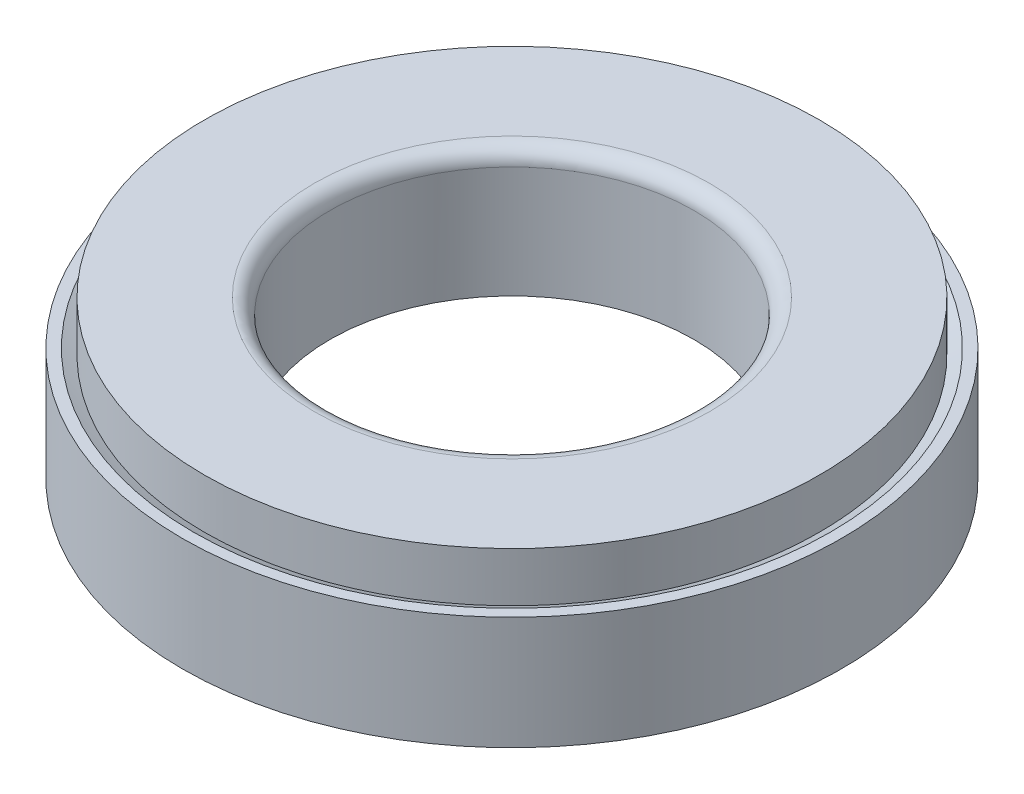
ISO-10303-21;
HEADER;
FILE_DESCRIPTION(('STEP AP214'),'2;1');
FILE_NAME('part.step','',(''),(''),'','','');
FILE_SCHEMA(('AUTOMOTIVE_DESIGN { 1 0 10303 214 1 1 1 1 }'));
ENDSEC;
DATA;
#1=APPLICATION_CONTEXT('core data for automotive mechanical design processes');
#2=APPLICATION_PROTOCOL_DEFINITION('international standard','automotive_design',2000,#1);
#3=PRODUCT_CONTEXT('',#1,'mechanical');
#4=PRODUCT('Part','Part','',(#3));
#5=PRODUCT_RELATED_PRODUCT_CATEGORY('part','',(#4));
#6=PRODUCT_DEFINITION_FORMATION('','',#4);
#7=PRODUCT_DEFINITION_CONTEXT('part definition',#1,'design');
#8=PRODUCT_DEFINITION('design','',#6,#7);
#9=PRODUCT_DEFINITION_SHAPE('','',#8);
#10=(LENGTH_UNIT() NAMED_UNIT(*) SI_UNIT(.MILLI.,.METRE.));
#11=(NAMED_UNIT(*) PLANE_ANGLE_UNIT() SI_UNIT($,.RADIAN.));
#12=(NAMED_UNIT(*) SI_UNIT($,.STERADIAN.) SOLID_ANGLE_UNIT());
#13=UNCERTAINTY_MEASURE_WITH_UNIT(LENGTH_MEASURE(1.E-05),#10,'distance_accuracy_value','');
#14=(GEOMETRIC_REPRESENTATION_CONTEXT(3) GLOBAL_UNCERTAINTY_ASSIGNED_CONTEXT((#13)) GLOBAL_UNIT_ASSIGNED_CONTEXT((#10,
#11,#12)) REPRESENTATION_CONTEXT('',''));
#15=CARTESIAN_POINT('',(0.,0.,0.));
#16=DIRECTION('',(0.,0.,1.));
#17=DIRECTION('',(1.,0.,0.));
#18=AXIS2_PLACEMENT_3D('',#15,#16,#17);
#19=CARTESIAN_POINT('',(0.,25.,0.));
#20=DIRECTION('',(0.,-1.,0.));
#21=DIRECTION('',(0.,0.,-1.));
#22=AXIS2_PLACEMENT_3D('',#19,#20,#21);
#23=CYLINDRICAL_SURFACE('',#22,49.);
#24=CARTESIAN_POINT('',(0.,17.0854664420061,0.));
#25=DIRECTION('',(0.,1.,0.));
#26=DIRECTION('',(0.,0.,1.));
#27=AXIS2_PLACEMENT_3D('',#24,#25,#26);
#28=CIRCLE('',#27,49.);
#29=CARTESIAN_POINT('',(0.,17.0854664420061,49.));
#30=VERTEX_POINT('',#29);
#31=EDGE_CURVE('P0_E29',#30,#30,#28,.T.);
#32=ORIENTED_EDGE('',*,*,#31,.T.);
#33=EDGE_LOOP('',(#32));
#34=FACE_BOUND('',#33,.T.);
#35=CARTESIAN_POINT('',(0.,25.,0.));
#36=DIRECTION('',(0.,1.,0.));
#37=DIRECTION('',(0.,0.,1.));
#38=AXIS2_PLACEMENT_3D('',#35,#36,#37);
#39=CIRCLE('',#38,49.);
#40=CARTESIAN_POINT('',(0.,25.,49.));
#41=VERTEX_POINT('',#40);
#42=EDGE_CURVE('P0_E25',#41,#41,#39,.T.);
#43=ORIENTED_EDGE('',*,*,#42,.F.);
#44=EDGE_LOOP('',(#43));
#45=FACE_BOUND('',#44,.T.);
#46=ADVANCED_FACE('P0_F14',(#34,#45),#23,.T.);
#47=CARTESIAN_POINT('',(0.,25.,0.));
#48=DIRECTION('',(0.,1.,0.));
#49=DIRECTION('',(0.,0.,1.));
#50=AXIS2_PLACEMENT_3D('',#47,#48,#49);
#51=PLANE('',#50);
#52=CARTESIAN_POINT('',(0.,25.,0.));
#53=DIRECTION('',(0.,1.,0.));
#54=DIRECTION('',(0.,0.,1.));
#55=AXIS2_PLACEMENT_3D('',#52,#53,#54);
#56=CIRCLE('',#55,31.5);
#57=CARTESIAN_POINT('',(0.,25.,31.5));
#58=VERTEX_POINT('',#57);
#59=EDGE_CURVE('P0_E21',#58,#58,#56,.F.);
#60=ORIENTED_EDGE('',*,*,#59,.T.);
#61=EDGE_LOOP('',(#60));
#62=FACE_BOUND('',#61,.T.);
#63=ORIENTED_EDGE('',*,*,#42,.T.);
#64=EDGE_LOOP('',(#63));
#65=FACE_BOUND('',#64,.T.);
#66=ADVANCED_FACE('P0_F92',(#62,#65),#51,.T.);
#67=CARTESIAN_POINT('',(0.,112.980729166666,0.));
#68=DIRECTION('',(-1.,0.,0.));
#69=DIRECTION('',(0.,-1.,0.));
#70=AXIS2_PLACEMENT_3D('',#67,#68,#69);
#71=SPHERICAL_SURFACE('',#70,107.68891035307);
#72=CARTESIAN_POINT('',(0.,112.980729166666,0.));
#73=DIRECTION('',(0.,1.,0.));
#74=DIRECTION('',(0.,0.,1.));
#75=AXIS2_PLACEMENT_3D('',#72,#73,#74);
#76=SPHERICAL_SURFACE('',#75,107.68891035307);
#77=CARTESIAN_POINT('',(0.,10.8,0.));
#78=DIRECTION('',(0.,1.,0.));
#79=DIRECTION('',(0.,0.,1.));
#80=AXIS2_PLACEMENT_3D('',#77,#78,#79);
#81=CIRCLE('',#80,34.);
#82=CARTESIAN_POINT('',(0.,10.8,34.));
#83=VERTEX_POINT('',#82);
#84=EDGE_CURVE('P0_E49',#83,#83,#81,.T.);
#85=ORIENTED_EDGE('',*,*,#84,.T.);
#86=EDGE_LOOP('',(#85));
#87=FACE_BOUND('',#86,.T.);
#88=ORIENTED_EDGE('',*,*,#31,.F.);
#89=EDGE_LOOP('',(#88));
#90=FACE_BOUND('',#89,.T.);
#91=ADVANCED_FACE('P0_F53',(#87,#90),#76,.T.);
#92=CARTESIAN_POINT('',(0.,4.7,0.));
#93=DIRECTION('',(0.,1.,0.));
#94=DIRECTION('',(0.,0.,1.));
#95=AXIS2_PLACEMENT_3D('',#92,#93,#94);
#96=CYLINDRICAL_SURFACE('',#95,34.);
#97=CARTESIAN_POINT('',(0.,7.75,0.));
#98=DIRECTION('',(0.,1.,0.));
#99=DIRECTION('',(0.,0.,1.));
#100=AXIS2_PLACEMENT_3D('',#97,#98,#99);
#101=CIRCLE('',#100,34.);
#102=CARTESIAN_POINT('',(0.,7.75,34.));
#103=VERTEX_POINT('',#102);
#104=EDGE_CURVE('P0_E40',#103,#103,#101,.T.);
#105=ORIENTED_EDGE('',*,*,#104,.F.);
#106=EDGE_LOOP('',(#105));
#107=FACE_BOUND('',#106,.T.);
#108=CARTESIAN_POINT('',(0.,4.7,0.));
#109=DIRECTION('',(0.,1.,0.));
#110=DIRECTION('',(0.,0.,1.));
#111=AXIS2_PLACEMENT_3D('',#108,#109,#110);
#112=CIRCLE('',#111,34.);
#113=CARTESIAN_POINT('',(0.,4.7,34.));
#114=VERTEX_POINT('',#113);
#115=EDGE_CURVE('P0_E33',#114,#114,#112,.T.);
#116=ORIENTED_EDGE('',*,*,#115,.T.);
#117=EDGE_LOOP('',(#116));
#118=FACE_BOUND('',#117,.T.);
#119=ADVANCED_FACE('P0_F75',(#107,#118),#96,.T.);
#120=CARTESIAN_POINT('',(0.,4.7,0.));
#121=DIRECTION('',(0.,1.,0.));
#122=DIRECTION('',(0.,0.,1.));
#123=AXIS2_PLACEMENT_3D('',#120,#121,#122);
#124=PLANE('',#123);
#125=CARTESIAN_POINT('',(0.,4.7,0.));
#126=DIRECTION('',(0.,-1.,0.));
#127=DIRECTION('',(0.,0.,-1.));
#128=AXIS2_PLACEMENT_3D('',#125,#126,#127);
#129=CIRCLE('',#128,29.);
#130=CARTESIAN_POINT('',(0.,4.7,-29.));
#131=VERTEX_POINT('',#130);
#132=EDGE_CURVE('P0_E37',#131,#131,#129,.T.);
#133=ORIENTED_EDGE('',*,*,#132,.F.);
#134=EDGE_LOOP('',(#133));
#135=FACE_BOUND('',#134,.T.);
#136=ORIENTED_EDGE('',*,*,#115,.F.);
#137=EDGE_LOOP('',(#136));
#138=FACE_BOUND('',#137,.T.);
#139=ADVANCED_FACE('P0_F78',(#135,#138),#124,.F.);
#140=CARTESIAN_POINT('',(0.,25.,0.));
#141=DIRECTION('',(0.,-1.,0.));
#142=DIRECTION('',(0.,0.,-1.));
#143=AXIS2_PLACEMENT_3D('',#140,#141,#142);
#144=CYLINDRICAL_SURFACE('',#143,29.);
#145=CARTESIAN_POINT('',(0.,22.5,0.));
#146=DIRECTION('',(0.,1.,0.));
#147=DIRECTION('',(0.,0.,1.));
#148=AXIS2_PLACEMENT_3D('',#145,#146,#147);
#149=CIRCLE('',#148,29.);
#150=CARTESIAN_POINT('',(0.,22.5,29.));
#151=VERTEX_POINT('',#150);
#152=EDGE_CURVE('P0_E10',#151,#151,#149,.T.);
#153=ORIENTED_EDGE('',*,*,#152,.T.);
#154=EDGE_LOOP('',(#153));
#155=FACE_BOUND('',#154,.T.);
#156=ORIENTED_EDGE('',*,*,#132,.T.);
#157=EDGE_LOOP('',(#156));
#158=FACE_BOUND('',#157,.T.);
#159=ADVANCED_FACE('P0_F71',(#155,#158),#144,.F.);
#160=CARTESIAN_POINT('',(-34.,7.75,0.));
#161=DIRECTION('',(0.,-1.,0.));
#162=DIRECTION('',(0.,0.,-1.));
#163=AXIS2_PLACEMENT_3D('',#160,#161,#162);
#164=PLANE('',#163);
#165=CARTESIAN_POINT('',(0.,7.75,0.));
#166=DIRECTION('',(0.,1.,0.));
#167=DIRECTION('',(0.,0.,1.));
#168=AXIS2_PLACEMENT_3D('',#165,#166,#167);
#169=CIRCLE('',#168,31.5);
#170=CARTESIAN_POINT('',(0.,7.75,31.5));
#171=VERTEX_POINT('',#170);
#172=EDGE_CURVE('P0_E43',#171,#171,#169,.T.);
#173=ORIENTED_EDGE('',*,*,#172,.F.);
#174=EDGE_LOOP('',(#173));
#175=FACE_BOUND('',#174,.T.);
#176=ORIENTED_EDGE('',*,*,#104,.T.);
#177=EDGE_LOOP('',(#176));
#178=FACE_BOUND('',#177,.T.);
#179=ADVANCED_FACE('P0_F65',(#175,#178),#164,.F.);
#180=CARTESIAN_POINT('',(0.,25.,0.));
#181=DIRECTION('',(0.,1.,0.));
#182=DIRECTION('',(0.,0.,1.));
#183=AXIS2_PLACEMENT_3D('',#180,#181,#182);
#184=CYLINDRICAL_SURFACE('',#183,31.5);
#185=CARTESIAN_POINT('',(0.,10.8,0.));
#186=DIRECTION('',(0.,1.,0.));
#187=DIRECTION('',(0.,0.,1.));
#188=AXIS2_PLACEMENT_3D('',#185,#186,#187);
#189=CIRCLE('',#188,31.5);
#190=CARTESIAN_POINT('',(0.,10.8,31.5));
#191=VERTEX_POINT('',#190);
#192=EDGE_CURVE('P0_E46',#191,#191,#189,.T.);
#193=ORIENTED_EDGE('',*,*,#192,.F.);
#194=EDGE_LOOP('',(#193));
#195=FACE_BOUND('',#194,.T.);
#196=ORIENTED_EDGE('',*,*,#172,.T.);
#197=EDGE_LOOP('',(#196));
#198=FACE_BOUND('',#197,.T.);
#199=ADVANCED_FACE('P0_F59',(#195,#198),#184,.T.);
#200=CARTESIAN_POINT('',(-34.,10.8,0.));
#201=DIRECTION('',(0.,1.,0.));
#202=DIRECTION('',(0.,0.,1.));
#203=AXIS2_PLACEMENT_3D('',#200,#201,#202);
#204=PLANE('',#203);
#205=ORIENTED_EDGE('',*,*,#84,.F.);
#206=EDGE_LOOP('',(#205));
#207=FACE_BOUND('',#206,.T.);
#208=ORIENTED_EDGE('',*,*,#192,.T.);
#209=EDGE_LOOP('',(#208));
#210=FACE_BOUND('',#209,.T.);
#211=ADVANCED_FACE('P0_F56',(#207,#210),#204,.F.);
#212=CARTESIAN_POINT('',(0.,22.5,0.));
#213=DIRECTION('',(0.,1.,0.));
#214=DIRECTION('',(0.,0.,1.));
#215=AXIS2_PLACEMENT_3D('',#212,#213,#214);
#216=TOROIDAL_SURFACE('',#215,31.5,2.5);
#217=ORIENTED_EDGE('',*,*,#152,.F.);
#218=EDGE_LOOP('',(#217));
#219=FACE_BOUND('',#218,.T.);
#220=ORIENTED_EDGE('',*,*,#59,.F.);
#221=EDGE_LOOP('',(#220));
#222=FACE_BOUND('',#221,.T.);
#223=ADVANCED_FACE('P0_F16',(#219,#222),#216,.T.);
#224=CLOSED_SHELL('',(#46,#66,#91,#119,#139,#159,#179,#199,#211,#223));
#225=MANIFOLD_SOLID_BREP('P0_B1',#224);
#226=CARTESIAN_POINT('',(0.,18.,0.));
#227=DIRECTION('',(0.,-1.,0.));
#228=DIRECTION('',(0.,0.,-1.));
#229=AXIS2_PLACEMENT_3D('',#226,#227,#228);
#230=CYLINDRICAL_SURFACE('',#229,52.5);
#231=CARTESIAN_POINT('',(0.,18.,0.));
#232=DIRECTION('',(0.,1.,0.));
#233=DIRECTION('',(0.,0.,1.));
#234=AXIS2_PLACEMENT_3D('',#231,#232,#233);
#235=CIRCLE('',#234,52.5);
#236=CARTESIAN_POINT('',(0.,18.,52.5));
#237=VERTEX_POINT('',#236);
#238=EDGE_CURVE('P1_E9',#237,#237,#235,.T.);
#239=ORIENTED_EDGE('',*,*,#238,.F.);
#240=EDGE_LOOP('',(#239));
#241=FACE_BOUND('',#240,.T.);
#242=CARTESIAN_POINT('',(0.,0.,0.));
#243=DIRECTION('',(0.,1.,0.));
#244=DIRECTION('',(0.,0.,1.));
#245=AXIS2_PLACEMENT_3D('',#242,#243,#244);
#246=CIRCLE('',#245,52.5);
#247=CARTESIAN_POINT('',(0.,0.,52.5));
#248=VERTEX_POINT('',#247);
#249=EDGE_CURVE('P1_E20',#248,#248,#246,.T.);
#250=ORIENTED_EDGE('',*,*,#249,.T.);
#251=EDGE_LOOP('',(#250));
#252=FACE_BOUND('',#251,.T.);
#253=ADVANCED_FACE('P1_F13',(#241,#252),#230,.T.);
#254=CARTESIAN_POINT('',(0.,18.,0.));
#255=DIRECTION('',(0.,1.,0.));
#256=DIRECTION('',(0.,0.,1.));
#257=AXIS2_PLACEMENT_3D('',#254,#255,#256);
#258=PLANE('',#257);
#259=CARTESIAN_POINT('',(0.,18.,0.));
#260=DIRECTION('',(0.,1.,0.));
#261=DIRECTION('',(0.,0.,1.));
#262=AXIS2_PLACEMENT_3D('',#259,#260,#261);
#263=CIRCLE('',#262,50.7500000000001);
#264=CARTESIAN_POINT('',(0.,18.,50.7500000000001));
#265=VERTEX_POINT('',#264);
#266=EDGE_CURVE('P1_E35',#265,#265,#263,.T.);
#267=ORIENTED_EDGE('',*,*,#266,.F.);
#268=EDGE_LOOP('',(#267));
#269=FACE_BOUND('',#268,.T.);
#270=ORIENTED_EDGE('',*,*,#238,.T.);
#271=EDGE_LOOP('',(#270));
#272=FACE_BOUND('',#271,.T.);
#273=ADVANCED_FACE('P1_F55',(#269,#272),#258,.T.);
#274=CARTESIAN_POINT('',(0.,0.,0.));
#275=DIRECTION('',(0.,1.,0.));
#276=DIRECTION('',(0.,0.,1.));
#277=AXIS2_PLACEMENT_3D('',#274,#275,#276);
#278=PLANE('',#277);
#279=CARTESIAN_POINT('',(0.,0.,0.));
#280=DIRECTION('',(0.,-1.,0.));
#281=DIRECTION('',(0.,0.,-1.));
#282=AXIS2_PLACEMENT_3D('',#279,#280,#281);
#283=CIRCLE('',#282,39.);
#284=CARTESIAN_POINT('',(0.,0.,-39.));
#285=VERTEX_POINT('',#284);
#286=EDGE_CURVE('P1_E27',#285,#285,#283,.T.);
#287=ORIENTED_EDGE('',*,*,#286,.F.);
#288=EDGE_LOOP('',(#287));
#289=FACE_BOUND('',#288,.T.);
#290=ORIENTED_EDGE('',*,*,#249,.F.);
#291=EDGE_LOOP('',(#290));
#292=FACE_BOUND('',#291,.T.);
#293=ADVANCED_FACE('P1_F60',(#289,#292),#278,.F.);
#294=CARTESIAN_POINT('',(0.,9.,0.));
#295=DIRECTION('',(0.,-1.,0.));
#296=DIRECTION('',(0.,0.,-1.));
#297=AXIS2_PLACEMENT_3D('',#294,#295,#296);
#298=CYLINDRICAL_SURFACE('',#297,39.);
#299=CARTESIAN_POINT('',(0.,9.,0.));
#300=DIRECTION('',(0.,-1.,0.));
#301=DIRECTION('',(0.,0.,-1.));
#302=AXIS2_PLACEMENT_3D('',#299,#300,#301);
#303=CIRCLE('',#302,39.);
#304=CARTESIAN_POINT('',(0.,9.,-39.));
#305=VERTEX_POINT('',#304);
#306=EDGE_CURVE('P1_E25',#305,#305,#303,.T.);
#307=ORIENTED_EDGE('',*,*,#306,.F.);
#308=EDGE_LOOP('',(#307));
#309=FACE_BOUND('',#308,.T.);
#310=ORIENTED_EDGE('',*,*,#286,.T.);
#311=EDGE_LOOP('',(#310));
#312=FACE_BOUND('',#311,.T.);
#313=ADVANCED_FACE('P1_F67',(#309,#312),#298,.F.);
#314=CARTESIAN_POINT('',(0.,9.,0.));
#315=DIRECTION('',(0.,-1.,0.));
#316=DIRECTION('',(0.,0.,-1.));
#317=AXIS2_PLACEMENT_3D('',#314,#315,#316);
#318=PLANE('',#317);
#319=CARTESIAN_POINT('',(0.,9.,0.));
#320=DIRECTION('',(0.,-1.,0.));
#321=DIRECTION('',(0.,0.,-1.));
#322=AXIS2_PLACEMENT_3D('',#319,#320,#321);
#323=CIRCLE('',#322,34.);
#324=CARTESIAN_POINT('',(0.,9.,-34.));
#325=VERTEX_POINT('',#324);
#326=EDGE_CURVE('P1_E30',#325,#325,#323,.T.);
#327=ORIENTED_EDGE('',*,*,#326,.F.);
#328=EDGE_LOOP('',(#327));
#329=FACE_BOUND('',#328,.T.);
#330=ORIENTED_EDGE('',*,*,#306,.T.);
#331=EDGE_LOOP('',(#330));
#332=FACE_BOUND('',#331,.T.);
#333=ADVANCED_FACE('P1_F52',(#329,#332),#318,.T.);
#334=CARTESIAN_POINT('',(0.,18.,0.));
#335=DIRECTION('',(0.,-1.,0.));
#336=DIRECTION('',(0.,0.,-1.));
#337=AXIS2_PLACEMENT_3D('',#334,#335,#336);
#338=CYLINDRICAL_SURFACE('',#337,34.);
#339=CARTESIAN_POINT('',(0.,10.8,0.));
#340=DIRECTION('',(0.,1.,0.));
#341=DIRECTION('',(0.,0.,1.));
#342=AXIS2_PLACEMENT_3D('',#339,#340,#341);
#343=CIRCLE('',#342,34.);
#344=CARTESIAN_POINT('',(0.,10.8,34.));
#345=VERTEX_POINT('',#344);
#346=EDGE_CURVE('P1_E16',#345,#345,#343,.T.);
#347=ORIENTED_EDGE('',*,*,#346,.T.);
#348=EDGE_LOOP('',(#347));
#349=FACE_BOUND('',#348,.T.);
#350=ORIENTED_EDGE('',*,*,#326,.T.);
#351=EDGE_LOOP('',(#350));
#352=FACE_BOUND('',#351,.T.);
#353=ADVANCED_FACE('P1_F42',(#349,#352),#338,.F.);
#354=CARTESIAN_POINT('',(0.,112.980729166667,0.));
#355=DIRECTION('',(-1.,0.,0.));
#356=DIRECTION('',(0.,1.,0.));
#357=AXIS2_PLACEMENT_3D('',#354,#355,#356);
#358=SPHERICAL_SURFACE('',#357,107.688910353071);
#359=CARTESIAN_POINT('',(0.,112.980729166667,0.));
#360=DIRECTION('',(0.,1.,0.));
#361=DIRECTION('',(0.,0.,1.));
#362=AXIS2_PLACEMENT_3D('',#359,#360,#361);
#363=SPHERICAL_SURFACE('',#362,107.688910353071);
#364=ORIENTED_EDGE('',*,*,#266,.T.);
#365=EDGE_LOOP('',(#364));
#366=FACE_BOUND('',#365,.T.);
#367=ORIENTED_EDGE('',*,*,#346,.F.);
#368=EDGE_LOOP('',(#367));
#369=FACE_BOUND('',#368,.T.);
#370=ADVANCED_FACE('P1_F45',(#366,#369),#363,.F.);
#371=CLOSED_SHELL('',(#253,#273,#293,#313,#333,#353,#370));
#372=MANIFOLD_SOLID_BREP('P1_B1',#371);
#373=ADVANCED_BREP_SHAPE_REPRESENTATION('',(#18,#225,#372),#14);
#374=SHAPE_DEFINITION_REPRESENTATION(#9,#373);
ENDSEC;
END-ISO-10303-21;
